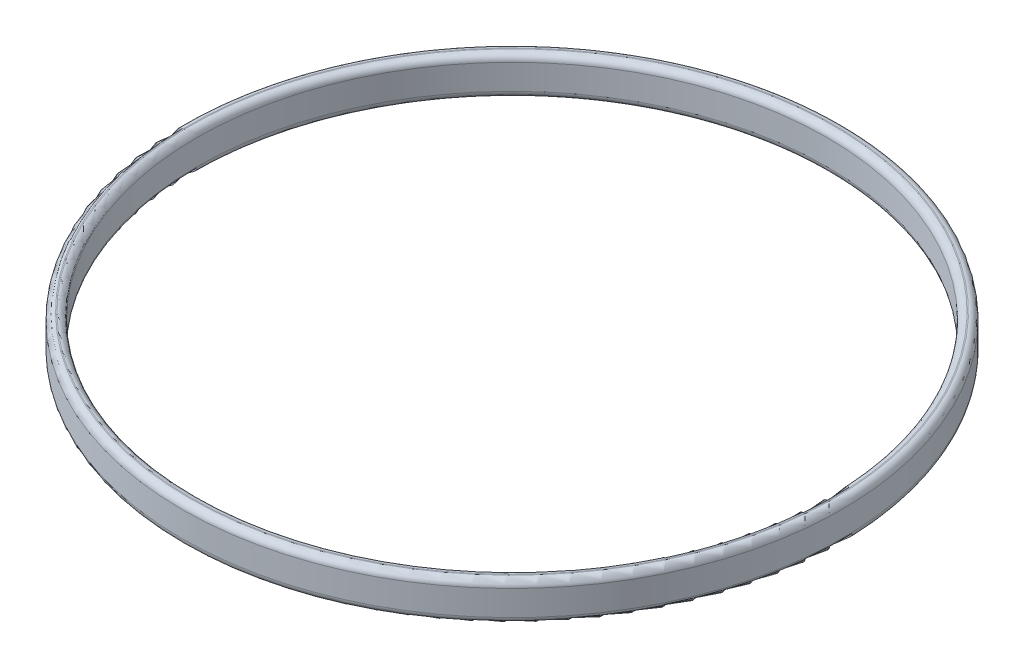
from build123d import *


with BuildPart() as part:
    # Sketch1 → Base-Revolve (revolve)
    with BuildSketch(Plane.XY, mode=Mode.PRIVATE) as base_revolve_sk:
        with BuildLine():
            Line((42.164, 2.54), (42.291, 2.54))
            ThreePointArc((42.291, 2.54), (42.919617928, 2.279617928), (43.18, 1.651))
            Line((43.18, 1.651), (43.18, -1.651))
            ThreePointArc((43.18, -1.651), (42.919617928, -2.279617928), (42.291, -2.54))
            Line((42.291, -2.54), (42.164, -2.54))
            ThreePointArc((42.164, -2.54), (41.535382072, -2.279617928), (41.275, -1.651))
            Line((41.275, -1.651), (41.275, 1.651))
            ThreePointArc((41.275, 1.651), (41.535382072, 2.279617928), (42.164, 2.54))
        make_face()
    revolve(base_revolve_sk.sketch.rotate(Axis((0, 14.709122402, 0), (0, -1, 0)), 90), axis=Axis((0, 14.709122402, 0), (0, -1, 0)))


solid = part.part
